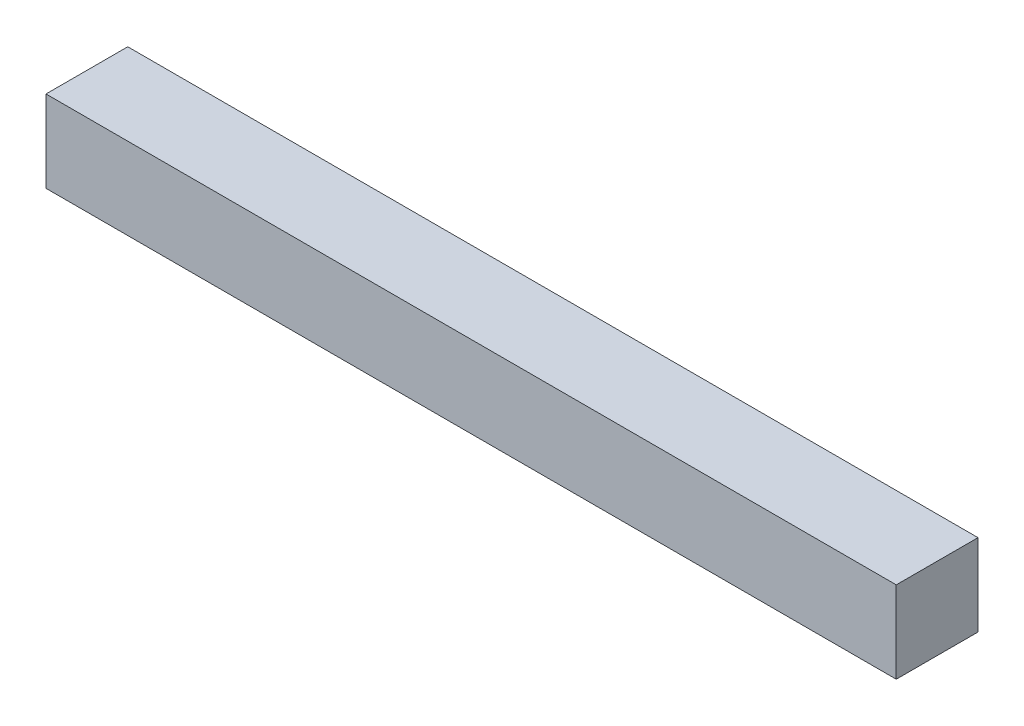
ISO-10303-21;
HEADER;
FILE_DESCRIPTION(('STEP AP214'),'2;1');
FILE_NAME('part.step','',(''),(''),'','','');
FILE_SCHEMA(('AUTOMOTIVE_DESIGN { 1 0 10303 214 1 1 1 1 }'));
ENDSEC;
DATA;
#1=APPLICATION_CONTEXT('core data for automotive mechanical design processes');
#2=APPLICATION_PROTOCOL_DEFINITION('international standard','automotive_design',2000,#1);
#3=PRODUCT_CONTEXT('',#1,'mechanical');
#4=PRODUCT('Part','Part','',(#3));
#5=PRODUCT_RELATED_PRODUCT_CATEGORY('part','',(#4));
#6=PRODUCT_DEFINITION_FORMATION('','',#4);
#7=PRODUCT_DEFINITION_CONTEXT('part definition',#1,'design');
#8=PRODUCT_DEFINITION('design','',#6,#7);
#9=PRODUCT_DEFINITION_SHAPE('','',#8);
#10=(LENGTH_UNIT() NAMED_UNIT(*) SI_UNIT(.MILLI.,.METRE.));
#11=(NAMED_UNIT(*) PLANE_ANGLE_UNIT() SI_UNIT($,.RADIAN.));
#12=(NAMED_UNIT(*) SI_UNIT($,.STERADIAN.) SOLID_ANGLE_UNIT());
#13=UNCERTAINTY_MEASURE_WITH_UNIT(LENGTH_MEASURE(1.E-05),#10,'distance_accuracy_value','');
#14=(GEOMETRIC_REPRESENTATION_CONTEXT(3) GLOBAL_UNCERTAINTY_ASSIGNED_CONTEXT((#13)) GLOBAL_UNIT_ASSIGNED_CONTEXT((#10,
#11,#12)) REPRESENTATION_CONTEXT('',''));
#15=CARTESIAN_POINT('',(0.,0.,0.));
#16=DIRECTION('',(0.,0.,1.));
#17=DIRECTION('',(1.,0.,0.));
#18=AXIS2_PLACEMENT_3D('',#15,#16,#17);
#19=CARTESIAN_POINT('',(0.,3.175,0.));
#20=DIRECTION('',(1.,0.,0.));
#21=DIRECTION('',(0.,0.,-1.));
#22=AXIS2_PLACEMENT_3D('',#19,#20,#21);
#23=PLANE('',#22);
#24=DIRECTION('',(0.,0.,1.));
#25=VECTOR('',#24,1.);
#26=CARTESIAN_POINT('',(0.,0.,0.));
#27=LINE('',#26,#25);
#28=CARTESIAN_POINT('',(0.,0.,-3.175));
#29=VERTEX_POINT('',#28);
#30=CARTESIAN_POINT('',(0.,0.,0.));
#31=VERTEX_POINT('',#30);
#32=EDGE_CURVE('E95',#29,#31,#27,.T.);
#33=ORIENTED_EDGE('',*,*,#32,.T.);
#34=DIRECTION('',(0.,-1.,0.));
#35=VECTOR('',#34,1.);
#36=CARTESIAN_POINT('',(0.,3.175,0.));
#37=LINE('',#36,#35);
#38=CARTESIAN_POINT('',(0.,3.175,0.));
#39=VERTEX_POINT('',#38);
#40=EDGE_CURVE('E11',#39,#31,#37,.T.);
#41=ORIENTED_EDGE('',*,*,#40,.F.);
#42=DIRECTION('',(0.,0.,1.));
#43=VECTOR('',#42,1.);
#44=CARTESIAN_POINT('',(0.,3.175,0.));
#45=LINE('',#44,#43);
#46=CARTESIAN_POINT('',(0.,3.175,-3.175));
#47=VERTEX_POINT('',#46);
#48=EDGE_CURVE('E83',#47,#39,#45,.T.);
#49=ORIENTED_EDGE('',*,*,#48,.F.);
#50=DIRECTION('',(0.,-1.,0.));
#51=VECTOR('',#50,1.);
#52=CARTESIAN_POINT('',(0.,3.175,-3.175));
#53=LINE('',#52,#51);
#54=EDGE_CURVE('E91',#47,#29,#53,.T.);
#55=ORIENTED_EDGE('',*,*,#54,.T.);
#56=EDGE_LOOP('',(#33,#41,#49,#55));
#57=FACE_BOUND('',#56,.T.);
#58=ADVANCED_FACE('F32',(#57),#23,.F.);
#59=CARTESIAN_POINT('',(0.,3.175,0.));
#60=DIRECTION('',(0.,0.,-1.));
#61=DIRECTION('',(-1.,0.,0.));
#62=AXIS2_PLACEMENT_3D('',#59,#60,#61);
#63=PLANE('',#62);
#64=DIRECTION('',(1.,0.,0.));
#65=VECTOR('',#64,1.);
#66=CARTESIAN_POINT('',(0.,0.,0.));
#67=LINE('',#66,#65);
#68=CARTESIAN_POINT('',(33.02,0.,0.));
#69=VERTEX_POINT('',#68);
#70=EDGE_CURVE('E87',#31,#69,#67,.T.);
#71=ORIENTED_EDGE('',*,*,#70,.T.);
#72=DIRECTION('',(0.,-1.,0.));
#73=VECTOR('',#72,1.);
#74=CARTESIAN_POINT('',(33.02,3.175,0.));
#75=LINE('',#74,#73);
#76=CARTESIAN_POINT('',(33.02,3.175,0.));
#77=VERTEX_POINT('',#76);
#78=EDGE_CURVE('E40',#77,#69,#75,.T.);
#79=ORIENTED_EDGE('',*,*,#78,.F.);
#80=DIRECTION('',(1.,0.,0.));
#81=VECTOR('',#80,1.);
#82=CARTESIAN_POINT('',(0.,3.175,0.));
#83=LINE('',#82,#81);
#84=EDGE_CURVE('E78',#39,#77,#83,.T.);
#85=ORIENTED_EDGE('',*,*,#84,.F.);
#86=ORIENTED_EDGE('',*,*,#40,.T.);
#87=EDGE_LOOP('',(#71,#79,#85,#86));
#88=FACE_BOUND('',#87,.T.);
#89=ADVANCED_FACE('F86',(#88),#63,.F.);
#90=CARTESIAN_POINT('',(33.02,3.175,0.));
#91=DIRECTION('',(-1.,0.,0.));
#92=DIRECTION('',(0.,0.,1.));
#93=AXIS2_PLACEMENT_3D('',#90,#91,#92);
#94=PLANE('',#93);
#95=DIRECTION('',(0.,0.,-1.));
#96=VECTOR('',#95,1.);
#97=CARTESIAN_POINT('',(33.02,0.,0.));
#98=LINE('',#97,#96);
#99=CARTESIAN_POINT('',(33.02,0.,-3.175));
#100=VERTEX_POINT('',#99);
#101=EDGE_CURVE('E65',#69,#100,#98,.T.);
#102=ORIENTED_EDGE('',*,*,#101,.T.);
#103=DIRECTION('',(0.,-1.,0.));
#104=VECTOR('',#103,1.);
#105=CARTESIAN_POINT('',(33.02,3.175,-3.175));
#106=LINE('',#105,#104);
#107=CARTESIAN_POINT('',(33.02,3.175,-3.175));
#108=VERTEX_POINT('',#107);
#109=EDGE_CURVE('E88',#108,#100,#106,.T.);
#110=ORIENTED_EDGE('',*,*,#109,.F.);
#111=DIRECTION('',(0.,0.,-1.));
#112=VECTOR('',#111,1.);
#113=CARTESIAN_POINT('',(33.02,3.175,0.));
#114=LINE('',#113,#112);
#115=EDGE_CURVE('E81',#77,#108,#114,.T.);
#116=ORIENTED_EDGE('',*,*,#115,.F.);
#117=ORIENTED_EDGE('',*,*,#78,.T.);
#118=EDGE_LOOP('',(#102,#110,#116,#117));
#119=FACE_BOUND('',#118,.T.);
#120=ADVANCED_FACE('F89',(#119),#94,.F.);
#121=CARTESIAN_POINT('',(0.,3.175,-3.175));
#122=DIRECTION('',(0.,0.,1.));
#123=DIRECTION('',(1.,0.,0.));
#124=AXIS2_PLACEMENT_3D('',#121,#122,#123);
#125=PLANE('',#124);
#126=DIRECTION('',(-1.,0.,0.));
#127=VECTOR('',#126,1.);
#128=CARTESIAN_POINT('',(0.,0.,-3.175));
#129=LINE('',#128,#127);
#130=EDGE_CURVE('E71',#100,#29,#129,.T.);
#131=ORIENTED_EDGE('',*,*,#130,.T.);
#132=ORIENTED_EDGE('',*,*,#54,.F.);
#133=DIRECTION('',(-1.,0.,0.));
#134=VECTOR('',#133,1.);
#135=CARTESIAN_POINT('',(0.,3.175,-3.175));
#136=LINE('',#135,#134);
#137=EDGE_CURVE('E48',#108,#47,#136,.T.);
#138=ORIENTED_EDGE('',*,*,#137,.F.);
#139=ORIENTED_EDGE('',*,*,#109,.T.);
#140=EDGE_LOOP('',(#131,#132,#138,#139));
#141=FACE_BOUND('',#140,.T.);
#142=ADVANCED_FACE('F102',(#141),#125,.F.);
#143=CARTESIAN_POINT('',(0.,3.175,0.));
#144=DIRECTION('',(0.,-1.,0.));
#145=DIRECTION('',(0.,0.,-1.));
#146=AXIS2_PLACEMENT_3D('',#143,#144,#145);
#147=PLANE('',#146);
#148=ORIENTED_EDGE('',*,*,#48,.T.);
#149=ORIENTED_EDGE('',*,*,#84,.T.);
#150=ORIENTED_EDGE('',*,*,#115,.T.);
#151=ORIENTED_EDGE('',*,*,#137,.T.);
#152=EDGE_LOOP('',(#148,#149,#150,#151));
#153=FACE_BOUND('',#152,.T.);
#154=ADVANCED_FACE('F79',(#153),#147,.F.);
#155=CARTESIAN_POINT('',(0.,0.,0.));
#156=DIRECTION('',(0.,-1.,0.));
#157=DIRECTION('',(0.,0.,-1.));
#158=AXIS2_PLACEMENT_3D('',#155,#156,#157);
#159=PLANE('',#158);
#160=ORIENTED_EDGE('',*,*,#32,.F.);
#161=ORIENTED_EDGE('',*,*,#130,.F.);
#162=ORIENTED_EDGE('',*,*,#101,.F.);
#163=ORIENTED_EDGE('',*,*,#70,.F.);
#164=EDGE_LOOP('',(#160,#161,#162,#163));
#165=FACE_BOUND('',#164,.T.);
#166=ADVANCED_FACE('F105',(#165),#159,.T.);
#167=CLOSED_SHELL('',(#58,#89,#120,#142,#154,#166));
#168=MANIFOLD_SOLID_BREP('B2',#167);
#169=ADVANCED_BREP_SHAPE_REPRESENTATION('',(#18,#168),#14);
#170=SHAPE_DEFINITION_REPRESENTATION(#9,#169);
ENDSEC;
END-ISO-10303-21;
